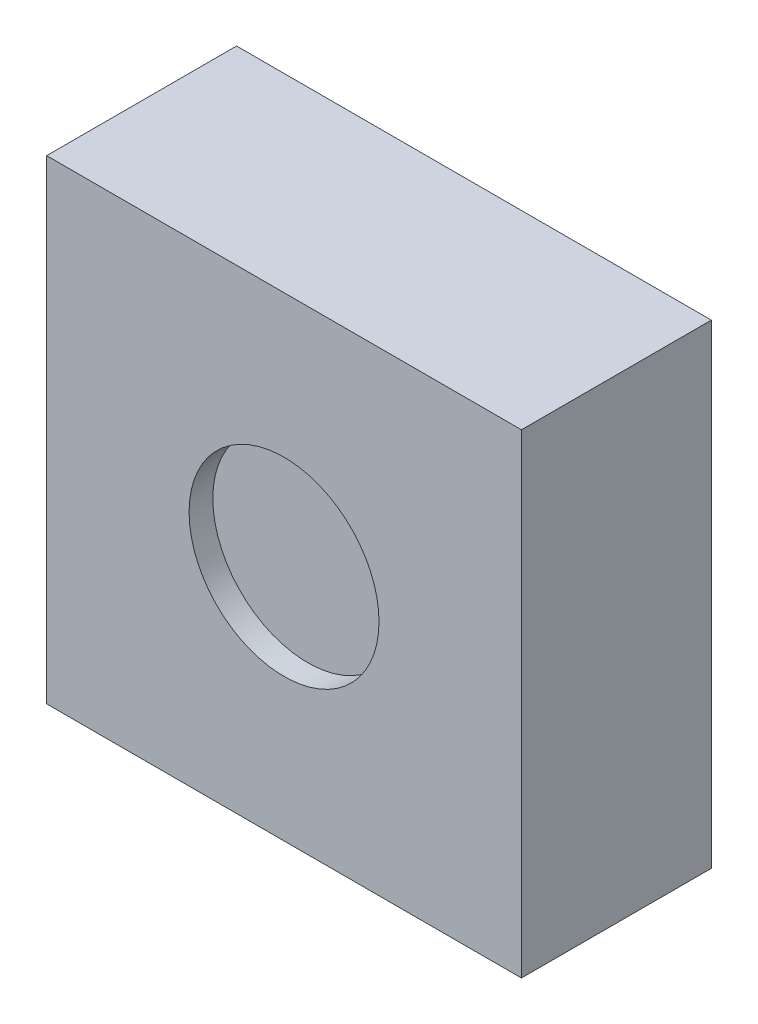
from build123d import *

# Parameters (mm, degrees)
SKETCH1_W          = 127
SKETCH1_H          = 127
EXTRUDE1_DEPTH     = 50.8
SKETCH2_R          = 25.4
CUT_EXTRUDE1_DEPTH = 6.35
SKETCH3_R          = 3.175
F_1_4_TAP_DEPTH    = 12.7


with BuildPart() as part:
    # Sketch1 → Extrude1 (new body)
    with BuildSketch(Plane.XY):
        Rectangle(SKETCH1_W, SKETCH1_H)
    extrude(amount=EXTRUDE1_DEPTH)

    # Sketch2 → Cut-Extrude1 (cut)
    with BuildSketch(Plane.XY.offset(50.8)):
        Circle(SKETCH2_R)
    extrude(amount=-CUT_EXTRUDE1_DEPTH, mode=Mode.SUBTRACT)

    # Sketch3 → 1_4_ Tap (cut)
    with BuildSketch(Plane(origin=(0, 0, 0), x_dir=(-1, 0, 0), z_dir=(0, 0, -1))):
        with Locations((-47.625, 47.625)):
            Circle(SKETCH3_R)
        with Locations(Location((47.625, 47.625, 0), (0, 0, 180))):
            Circle(SKETCH3_R)
        with Locations((47.625, -47.625)):
            Circle(SKETCH3_R)
        with Locations(Location((-47.625, -47.625, 0), (0, 0, 180))):
            Circle(SKETCH3_R)
    extrude(amount=-F_1_4_TAP_DEPTH, mode=Mode.SUBTRACT)


solid = part.part
